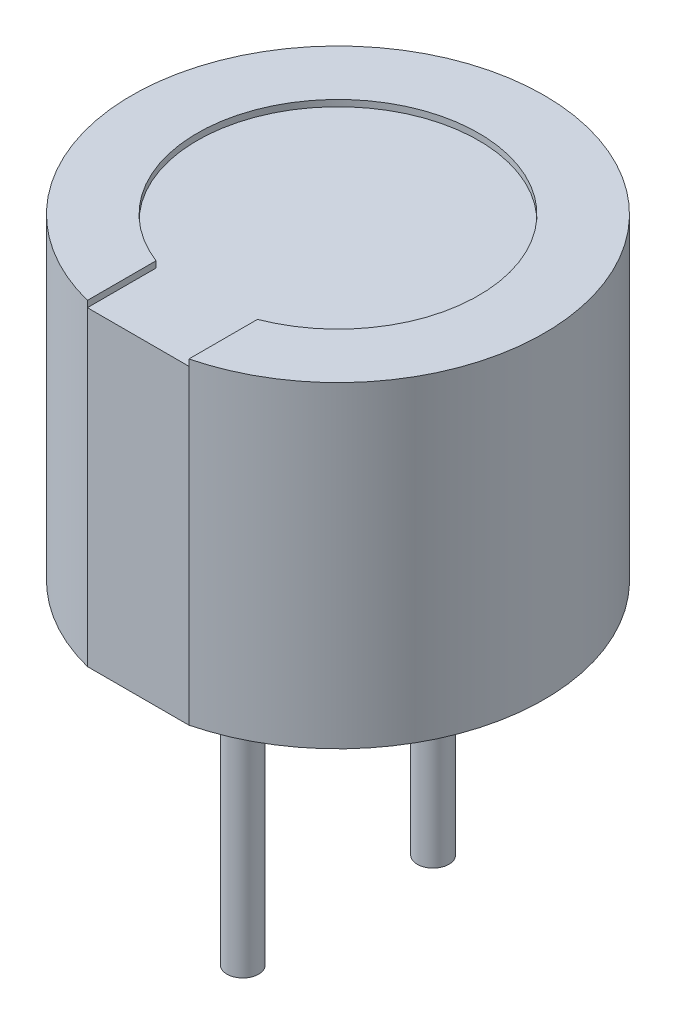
ISO-10303-21;
HEADER;
FILE_DESCRIPTION(('STEP AP214'),'2;1');
FILE_NAME('part.step','',(''),(''),'','','');
FILE_SCHEMA(('AUTOMOTIVE_DESIGN { 1 0 10303 214 1 1 1 1 }'));
ENDSEC;
DATA;
#1=APPLICATION_CONTEXT('core data for automotive mechanical design processes');
#2=APPLICATION_PROTOCOL_DEFINITION('international standard','automotive_design',2000,#1);
#3=PRODUCT_CONTEXT('',#1,'mechanical');
#4=PRODUCT('Part','Part','',(#3));
#5=PRODUCT_RELATED_PRODUCT_CATEGORY('part','',(#4));
#6=PRODUCT_DEFINITION_FORMATION('','',#4);
#7=PRODUCT_DEFINITION_CONTEXT('part definition',#1,'design');
#8=PRODUCT_DEFINITION('design','',#6,#7);
#9=PRODUCT_DEFINITION_SHAPE('','',#8);
#10=(LENGTH_UNIT() NAMED_UNIT(*) SI_UNIT(.MILLI.,.METRE.));
#11=(NAMED_UNIT(*) PLANE_ANGLE_UNIT() SI_UNIT($,.RADIAN.));
#12=(NAMED_UNIT(*) SI_UNIT($,.STERADIAN.) SOLID_ANGLE_UNIT());
#13=UNCERTAINTY_MEASURE_WITH_UNIT(LENGTH_MEASURE(1.E-05),#10,'distance_accuracy_value','');
#14=(GEOMETRIC_REPRESENTATION_CONTEXT(3) GLOBAL_UNCERTAINTY_ASSIGNED_CONTEXT((#13)) GLOBAL_UNIT_ASSIGNED_CONTEXT((#10,
#11,#12)) REPRESENTATION_CONTEXT('',''));
#15=CARTESIAN_POINT('',(0.,0.,0.));
#16=DIRECTION('',(0.,0.,1.));
#17=DIRECTION('',(1.,0.,0.));
#18=AXIS2_PLACEMENT_3D('',#15,#16,#17);
#19=CARTESIAN_POINT('',(-1.,5.,3.15));
#20=DIRECTION('',(0.,0.,-1.));
#21=DIRECTION('',(-1.,0.,0.));
#22=AXIS2_PLACEMENT_3D('',#19,#20,#21);
#23=PLANE('',#22);
#24=DIRECTION('',(1.,0.,0.));
#25=VECTOR('',#24,1.);
#26=CARTESIAN_POINT('',(-0.800000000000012,4.9,3.15));
#27=LINE('',#26,#25);
#28=CARTESIAN_POINT('',(-0.800000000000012,4.9,3.15));
#29=VERTEX_POINT('',#28);
#30=CARTESIAN_POINT('',(0.800000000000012,4.9,3.15));
#31=VERTEX_POINT('',#30);
#32=EDGE_CURVE('E105',#29,#31,#27,.T.);
#33=ORIENTED_EDGE('',*,*,#32,.F.);
#34=DIRECTION('',(0.,-1.,0.));
#35=VECTOR('',#34,1.);
#36=CARTESIAN_POINT('',(-0.800000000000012,5.,3.15));
#37=LINE('',#36,#35);
#38=CARTESIAN_POINT('',(-0.800000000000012,0.,3.15));
#39=VERTEX_POINT('',#38);
#40=EDGE_CURVE('E50',#39,#29,#37,.F.);
#41=ORIENTED_EDGE('',*,*,#40,.F.);
#42=DIRECTION('',(-1.,0.,0.));
#43=VECTOR('',#42,1.);
#44=CARTESIAN_POINT('',(0.,0.,3.15));
#45=LINE('',#44,#43);
#46=CARTESIAN_POINT('',(0.800000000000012,0.,3.15));
#47=VERTEX_POINT('',#46);
#48=EDGE_CURVE('E126',#47,#39,#45,.T.);
#49=ORIENTED_EDGE('',*,*,#48,.F.);
#50=DIRECTION('',(0.,-1.,0.));
#51=VECTOR('',#50,1.);
#52=CARTESIAN_POINT('',(0.800000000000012,5.,3.15));
#53=LINE('',#52,#51);
#54=EDGE_CURVE('E118',#31,#47,#53,.T.);
#55=ORIENTED_EDGE('',*,*,#54,.F.);
#56=EDGE_LOOP('',(#33,#41,#49,#55));
#57=FACE_BOUND('',#56,.T.);
#58=ADVANCED_FACE('F27',(#57),#23,.F.);
#59=CARTESIAN_POINT('',(0.,0.,0.));
#60=DIRECTION('',(0.,1.,0.));
#61=DIRECTION('',(0.,0.,1.));
#62=AXIS2_PLACEMENT_3D('',#59,#60,#61);
#63=PLANE('',#62);
#64=CARTESIAN_POINT('',(0.,0.,1.5));
#65=DIRECTION('',(0.,1.,0.));
#66=DIRECTION('',(0.,0.,1.));
#67=AXIS2_PLACEMENT_3D('',#64,#65,#66);
#68=CIRCLE('',#67,0.25);
#69=CARTESIAN_POINT('',(0.,0.,1.75));
#70=VERTEX_POINT('',#69);
#71=EDGE_CURVE('E35',#70,#70,#68,.F.);
#72=ORIENTED_EDGE('',*,*,#71,.F.);
#73=EDGE_LOOP('',(#72));
#74=FACE_BOUND('',#73,.T.);
#75=CARTESIAN_POINT('',(0.,0.,0.));
#76=DIRECTION('',(0.,1.,0.));
#77=DIRECTION('',(0.,0.,1.));
#78=AXIS2_PLACEMENT_3D('',#75,#76,#77);
#79=CIRCLE('',#78,3.25);
#80=EDGE_CURVE('E122',#47,#39,#79,.T.);
#81=ORIENTED_EDGE('',*,*,#80,.F.);
#82=ORIENTED_EDGE('',*,*,#48,.T.);
#83=EDGE_LOOP('',(#81,#82));
#84=FACE_BOUND('',#83,.T.);
#85=CARTESIAN_POINT('',(0.,0.,-1.5));
#86=DIRECTION('',(0.,1.,0.));
#87=DIRECTION('',(0.,0.,1.));
#88=AXIS2_PLACEMENT_3D('',#85,#86,#87);
#89=CIRCLE('',#88,0.25);
#90=CARTESIAN_POINT('',(0.,0.,-1.25));
#91=VERTEX_POINT('',#90);
#92=EDGE_CURVE('E11',#91,#91,#89,.F.);
#93=ORIENTED_EDGE('',*,*,#92,.F.);
#94=EDGE_LOOP('',(#93));
#95=FACE_BOUND('',#94,.T.);
#96=ADVANCED_FACE('F132',(#74,#84,#95),#63,.F.);
#97=CARTESIAN_POINT('',(0.,5.,0.));
#98=DIRECTION('',(0.,-1.,0.));
#99=DIRECTION('',(0.,0.,-1.));
#100=AXIS2_PLACEMENT_3D('',#97,#98,#99);
#101=CYLINDRICAL_SURFACE('',#100,3.25);
#102=CARTESIAN_POINT('',(0.,5.,0.));
#103=DIRECTION('',(0.,1.,0.));
#104=DIRECTION('',(0.,0.,1.));
#105=AXIS2_PLACEMENT_3D('',#102,#103,#104);
#106=CIRCLE('',#105,3.25);
#107=CARTESIAN_POINT('',(0.800000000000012,5.,3.15));
#108=VERTEX_POINT('',#107);
#109=CARTESIAN_POINT('',(-0.800000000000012,5.,3.15));
#110=VERTEX_POINT('',#109);
#111=EDGE_CURVE('E97',#108,#110,#106,.T.);
#112=ORIENTED_EDGE('',*,*,#111,.F.);
#113=EDGE_CURVE('E119',#108,#31,#53,.T.);
#114=ORIENTED_EDGE('',*,*,#113,.T.);
#115=ORIENTED_EDGE('',*,*,#54,.T.);
#116=ORIENTED_EDGE('',*,*,#80,.T.);
#117=ORIENTED_EDGE('',*,*,#40,.T.);
#118=DIRECTION('',(0.,1.,0.));
#119=VECTOR('',#118,1.);
#120=CARTESIAN_POINT('',(-0.800000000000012,4.9,3.15));
#121=LINE('',#120,#119);
#122=EDGE_CURVE('E83',#29,#110,#121,.T.);
#123=ORIENTED_EDGE('',*,*,#122,.T.);
#124=EDGE_LOOP('',(#112,#114,#115,#116,#117,#123));
#125=FACE_BOUND('',#124,.T.);
#126=ADVANCED_FACE('F29',(#125),#101,.T.);
#127=CARTESIAN_POINT('',(0.,5.,0.));
#128=DIRECTION('',(0.,1.,0.));
#129=DIRECTION('',(0.,0.,1.));
#130=AXIS2_PLACEMENT_3D('',#127,#128,#129);
#131=PLANE('',#130);
#132=DIRECTION('',(0.,0.,-1.));
#133=VECTOR('',#132,1.);
#134=CARTESIAN_POINT('',(0.800000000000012,5.,2.06876384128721));
#135=LINE('',#134,#133);
#136=CARTESIAN_POINT('',(0.800000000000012,5.,2.06876384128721));
#137=VERTEX_POINT('',#136);
#138=EDGE_CURVE('E98',#108,#137,#135,.T.);
#139=ORIENTED_EDGE('',*,*,#138,.F.);
#140=ORIENTED_EDGE('',*,*,#111,.T.);
#141=DIRECTION('',(0.,0.,1.));
#142=VECTOR('',#141,1.);
#143=CARTESIAN_POINT('',(-0.800000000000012,5.,2.06876384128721));
#144=LINE('',#143,#142);
#145=CARTESIAN_POINT('',(-0.800000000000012,5.,2.06876384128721));
#146=VERTEX_POINT('',#145);
#147=EDGE_CURVE('E79',#146,#110,#144,.T.);
#148=ORIENTED_EDGE('',*,*,#147,.F.);
#149=CARTESIAN_POINT('',(0.,5.,0.));
#150=DIRECTION('',(0.,1.,0.));
#151=DIRECTION('',(0.,0.,1.));
#152=AXIS2_PLACEMENT_3D('',#149,#150,#151);
#153=CIRCLE('',#152,2.21805857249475);
#154=EDGE_CURVE('E87',#137,#146,#153,.T.);
#155=ORIENTED_EDGE('',*,*,#154,.F.);
#156=EDGE_LOOP('',(#139,#140,#148,#155));
#157=FACE_BOUND('',#156,.T.);
#158=ADVANCED_FACE('F95',(#157),#131,.T.);
#159=CARTESIAN_POINT('',(0.,-4.5,1.5));
#160=DIRECTION('',(0.,1.,0.));
#161=DIRECTION('',(0.,0.,1.));
#162=AXIS2_PLACEMENT_3D('',#159,#160,#161);
#163=CYLINDRICAL_SURFACE('',#162,0.25);
#164=CARTESIAN_POINT('',(0.,-4.5,1.5));
#165=DIRECTION('',(0.,-1.,0.));
#166=DIRECTION('',(0.,0.,-1.));
#167=AXIS2_PLACEMENT_3D('',#164,#165,#166);
#168=CIRCLE('',#167,0.25);
#169=CARTESIAN_POINT('',(0.,-4.5,1.25));
#170=VERTEX_POINT('',#169);
#171=EDGE_CURVE('E114',#170,#170,#168,.T.);
#172=ORIENTED_EDGE('',*,*,#171,.F.);
#173=EDGE_LOOP('',(#172));
#174=FACE_BOUND('',#173,.T.);
#175=ORIENTED_EDGE('',*,*,#71,.T.);
#176=EDGE_LOOP('',(#175));
#177=FACE_BOUND('',#176,.T.);
#178=ADVANCED_FACE('F130',(#174,#177),#163,.T.);
#179=CARTESIAN_POINT('',(0.,-4.5,1.5));
#180=DIRECTION('',(0.,-1.,0.));
#181=DIRECTION('',(0.,0.,-1.));
#182=AXIS2_PLACEMENT_3D('',#179,#180,#181);
#183=PLANE('',#182);
#184=ORIENTED_EDGE('',*,*,#171,.T.);
#185=EDGE_LOOP('',(#184));
#186=FACE_BOUND('',#185,.T.);
#187=ADVANCED_FACE('F143',(#186),#183,.T.);
#188=CARTESIAN_POINT('',(0.,-4.5,-1.5));
#189=DIRECTION('',(0.,1.,0.));
#190=DIRECTION('',(0.,0.,1.));
#191=AXIS2_PLACEMENT_3D('',#188,#189,#190);
#192=CYLINDRICAL_SURFACE('',#191,0.25);
#193=CARTESIAN_POINT('',(0.,-4.5,-1.5));
#194=DIRECTION('',(0.,-1.,0.));
#195=DIRECTION('',(0.,0.,-1.));
#196=AXIS2_PLACEMENT_3D('',#193,#194,#195);
#197=CIRCLE('',#196,0.25);
#198=CARTESIAN_POINT('',(0.,-4.5,-1.75));
#199=VERTEX_POINT('',#198);
#200=EDGE_CURVE('E110',#199,#199,#197,.T.);
#201=ORIENTED_EDGE('',*,*,#200,.F.);
#202=EDGE_LOOP('',(#201));
#203=FACE_BOUND('',#202,.T.);
#204=ORIENTED_EDGE('',*,*,#92,.T.);
#205=EDGE_LOOP('',(#204));
#206=FACE_BOUND('',#205,.T.);
#207=ADVANCED_FACE('F140',(#203,#206),#192,.T.);
#208=CARTESIAN_POINT('',(0.,-4.5,-1.5));
#209=DIRECTION('',(0.,-1.,0.));
#210=DIRECTION('',(0.,0.,-1.));
#211=AXIS2_PLACEMENT_3D('',#208,#209,#210);
#212=PLANE('',#211);
#213=ORIENTED_EDGE('',*,*,#200,.T.);
#214=EDGE_LOOP('',(#213));
#215=FACE_BOUND('',#214,.T.);
#216=ADVANCED_FACE('F142',(#215),#212,.T.);
#217=CARTESIAN_POINT('',(0.,4.9,0.));
#218=DIRECTION('',(0.,1.,0.));
#219=DIRECTION('',(0.,0.,1.));
#220=AXIS2_PLACEMENT_3D('',#217,#218,#219);
#221=CYLINDRICAL_SURFACE('',#220,2.21805857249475);
#222=ORIENTED_EDGE('',*,*,#154,.T.);
#223=DIRECTION('',(0.,1.,0.));
#224=VECTOR('',#223,1.);
#225=CARTESIAN_POINT('',(-0.800000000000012,4.9,2.06876384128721));
#226=LINE('',#225,#224);
#227=CARTESIAN_POINT('',(-0.800000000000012,4.9,2.06876384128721));
#228=VERTEX_POINT('',#227);
#229=EDGE_CURVE('E75',#228,#146,#226,.T.);
#230=ORIENTED_EDGE('',*,*,#229,.F.);
#231=CARTESIAN_POINT('',(0.,4.9,0.));
#232=DIRECTION('',(0.,1.,0.));
#233=DIRECTION('',(0.,0.,1.));
#234=AXIS2_PLACEMENT_3D('',#231,#232,#233);
#235=CIRCLE('',#234,2.21805857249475);
#236=CARTESIAN_POINT('',(0.800000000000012,4.9,2.06876384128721));
#237=VERTEX_POINT('',#236);
#238=EDGE_CURVE('E100',#237,#228,#235,.T.);
#239=ORIENTED_EDGE('',*,*,#238,.F.);
#240=DIRECTION('',(0.,1.,0.));
#241=VECTOR('',#240,1.);
#242=CARTESIAN_POINT('',(0.800000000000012,4.9,2.06876384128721));
#243=LINE('',#242,#241);
#244=EDGE_CURVE('E89',#237,#137,#243,.T.);
#245=ORIENTED_EDGE('',*,*,#244,.T.);
#246=EDGE_LOOP('',(#222,#230,#239,#245));
#247=FACE_BOUND('',#246,.T.);
#248=ADVANCED_FACE('F88',(#247),#221,.F.);
#249=CARTESIAN_POINT('',(0.800000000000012,4.9,2.06876384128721));
#250=DIRECTION('',(1.,0.,0.));
#251=DIRECTION('',(0.,0.,-1.));
#252=AXIS2_PLACEMENT_3D('',#249,#250,#251);
#253=PLANE('',#252);
#254=ORIENTED_EDGE('',*,*,#138,.T.);
#255=ORIENTED_EDGE('',*,*,#244,.F.);
#256=DIRECTION('',(0.,0.,-1.));
#257=VECTOR('',#256,1.);
#258=CARTESIAN_POINT('',(0.800000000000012,4.9,2.06876384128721));
#259=LINE('',#258,#257);
#260=EDGE_CURVE('E84',#31,#237,#259,.T.);
#261=ORIENTED_EDGE('',*,*,#260,.F.);
#262=ORIENTED_EDGE('',*,*,#113,.F.);
#263=EDGE_LOOP('',(#254,#255,#261,#262));
#264=FACE_BOUND('',#263,.T.);
#265=ADVANCED_FACE('F174',(#264),#253,.F.);
#266=CARTESIAN_POINT('',(-0.800000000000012,4.9,2.06876384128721));
#267=DIRECTION('',(-1.,0.,0.));
#268=DIRECTION('',(0.,0.,1.));
#269=AXIS2_PLACEMENT_3D('',#266,#267,#268);
#270=PLANE('',#269);
#271=ORIENTED_EDGE('',*,*,#147,.T.);
#272=ORIENTED_EDGE('',*,*,#122,.F.);
#273=DIRECTION('',(0.,0.,1.));
#274=VECTOR('',#273,1.);
#275=CARTESIAN_POINT('',(-0.800000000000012,4.9,2.06876384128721));
#276=LINE('',#275,#274);
#277=EDGE_CURVE('E42',#228,#29,#276,.T.);
#278=ORIENTED_EDGE('',*,*,#277,.F.);
#279=ORIENTED_EDGE('',*,*,#229,.T.);
#280=EDGE_LOOP('',(#271,#272,#278,#279));
#281=FACE_BOUND('',#280,.T.);
#282=ADVANCED_FACE('F77',(#281),#270,.F.);
#283=CARTESIAN_POINT('',(0.,4.9,0.));
#284=DIRECTION('',(0.,1.,0.));
#285=DIRECTION('',(0.,0.,1.));
#286=AXIS2_PLACEMENT_3D('',#283,#284,#285);
#287=PLANE('',#286);
#288=ORIENTED_EDGE('',*,*,#238,.T.);
#289=ORIENTED_EDGE('',*,*,#277,.T.);
#290=ORIENTED_EDGE('',*,*,#32,.T.);
#291=ORIENTED_EDGE('',*,*,#260,.T.);
#292=EDGE_LOOP('',(#288,#289,#290,#291));
#293=FACE_BOUND('',#292,.T.);
#294=ADVANCED_FACE('F172',(#293),#287,.T.);
#295=CLOSED_SHELL('',(#58,#96,#126,#158,#178,#187,#207,#216,#248,#265,#282,#294));
#296=MANIFOLD_SOLID_BREP('B2',#295);
#297=ADVANCED_BREP_SHAPE_REPRESENTATION('',(#18,#296),#14);
#298=SHAPE_DEFINITION_REPRESENTATION(#9,#297);
ENDSEC;
END-ISO-10303-21;
